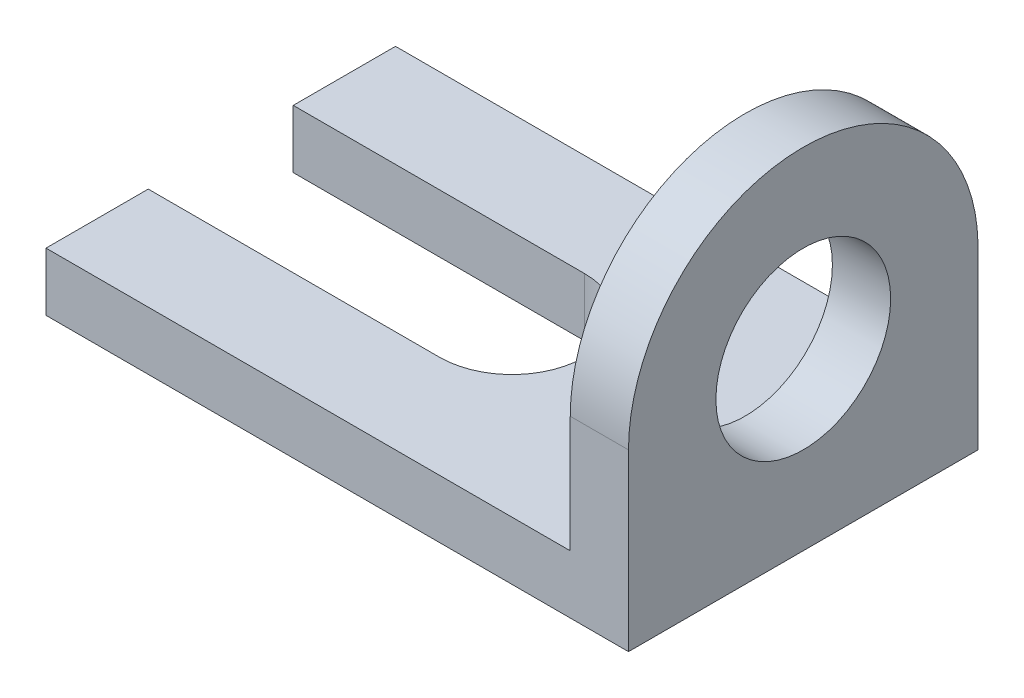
ISO-10303-21;
HEADER;
FILE_DESCRIPTION(('STEP AP214'),'2;1');
FILE_NAME('part.step','',(''),(''),'','','');
FILE_SCHEMA(('AUTOMOTIVE_DESIGN { 1 0 10303 214 1 1 1 1 }'));
ENDSEC;
DATA;
#1=APPLICATION_CONTEXT('core data for automotive mechanical design processes');
#2=APPLICATION_PROTOCOL_DEFINITION('international standard','automotive_design',2000,#1);
#3=PRODUCT_CONTEXT('',#1,'mechanical');
#4=PRODUCT('Part','Part','',(#3));
#5=PRODUCT_RELATED_PRODUCT_CATEGORY('part','',(#4));
#6=PRODUCT_DEFINITION_FORMATION('','',#4);
#7=PRODUCT_DEFINITION_CONTEXT('part definition',#1,'design');
#8=PRODUCT_DEFINITION('design','',#6,#7);
#9=PRODUCT_DEFINITION_SHAPE('','',#8);
#10=(LENGTH_UNIT() NAMED_UNIT(*) SI_UNIT(.MILLI.,.METRE.));
#11=(NAMED_UNIT(*) PLANE_ANGLE_UNIT() SI_UNIT($,.RADIAN.));
#12=(NAMED_UNIT(*) SI_UNIT($,.STERADIAN.) SOLID_ANGLE_UNIT());
#13=UNCERTAINTY_MEASURE_WITH_UNIT(LENGTH_MEASURE(1.E-05),#10,'distance_accuracy_value','');
#14=(GEOMETRIC_REPRESENTATION_CONTEXT(3) GLOBAL_UNCERTAINTY_ASSIGNED_CONTEXT((#13)) GLOBAL_UNIT_ASSIGNED_CONTEXT((#10,
#11,#12)) REPRESENTATION_CONTEXT('',''));
#15=CARTESIAN_POINT('',(0.,0.,0.));
#16=DIRECTION('',(0.,0.,1.));
#17=DIRECTION('',(1.,0.,0.));
#18=AXIS2_PLACEMENT_3D('',#15,#16,#17);
#19=CARTESIAN_POINT('',(-50.,10.,-30.));
#20=DIRECTION('',(1.,0.,0.));
#21=DIRECTION('',(0.,0.,-1.));
#22=AXIS2_PLACEMENT_3D('',#19,#20,#21);
#23=PLANE('',#22);
#24=DIRECTION('',(0.,0.,1.));
#25=VECTOR('',#24,1.);
#26=CARTESIAN_POINT('',(-50.,0.,-30.));
#27=LINE('',#26,#25);
#28=CARTESIAN_POINT('',(-50.,0.,-30.));
#29=VERTEX_POINT('',#28);
#30=CARTESIAN_POINT('',(-50.,0.,-12.4462253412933));
#31=VERTEX_POINT('',#30);
#32=EDGE_CURVE('E166',#29,#31,#27,.T.);
#33=ORIENTED_EDGE('',*,*,#32,.T.);
#34=DIRECTION('',(0.,-1.,0.));
#35=VECTOR('',#34,1.);
#36=CARTESIAN_POINT('',(-50.,10.,-12.4462253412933));
#37=LINE('',#36,#35);
#38=CARTESIAN_POINT('',(-50.,10.,-12.4462253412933));
#39=VERTEX_POINT('',#38);
#40=EDGE_CURVE('E11',#39,#31,#37,.T.);
#41=ORIENTED_EDGE('',*,*,#40,.F.);
#42=DIRECTION('',(0.,0.,1.));
#43=VECTOR('',#42,1.);
#44=CARTESIAN_POINT('',(-50.,10.,-30.));
#45=LINE('',#44,#43);
#46=CARTESIAN_POINT('',(-50.,10.,-30.));
#47=VERTEX_POINT('',#46);
#48=EDGE_CURVE('E170',#47,#39,#45,.T.);
#49=ORIENTED_EDGE('',*,*,#48,.F.);
#50=DIRECTION('',(0.,-1.,0.));
#51=VECTOR('',#50,1.);
#52=CARTESIAN_POINT('',(-50.,10.,-30.));
#53=LINE('',#52,#51);
#54=EDGE_CURVE('E145',#47,#29,#53,.T.);
#55=ORIENTED_EDGE('',*,*,#54,.T.);
#56=EDGE_LOOP('',(#33,#41,#49,#55));
#57=FACE_BOUND('',#56,.T.);
#58=ADVANCED_FACE('F31',(#57),#23,.F.);
#59=CARTESIAN_POINT('',(-50.,10.,-12.4462253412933));
#60=DIRECTION('',(0.,0.,-1.));
#61=DIRECTION('',(-1.,0.,0.));
#62=AXIS2_PLACEMENT_3D('',#59,#60,#61);
#63=PLANE('',#62);
#64=DIRECTION('',(1.,0.,0.));
#65=VECTOR('',#64,1.);
#66=CARTESIAN_POINT('',(-50.,0.,-12.4462253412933));
#67=LINE('',#66,#65);
#68=CARTESIAN_POINT('',(0.,0.,-12.4462253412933));
#69=VERTEX_POINT('',#68);
#70=EDGE_CURVE('E176',#31,#69,#67,.T.);
#71=ORIENTED_EDGE('',*,*,#70,.T.);
#72=DIRECTION('',(0.,-1.,0.));
#73=VECTOR('',#72,1.);
#74=CARTESIAN_POINT('',(0.,10.,-12.4462253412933));
#75=LINE('',#74,#73);
#76=CARTESIAN_POINT('',(0.,10.,-12.4462253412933));
#77=VERTEX_POINT('',#76);
#78=EDGE_CURVE('E39',#77,#69,#75,.T.);
#79=ORIENTED_EDGE('',*,*,#78,.F.);
#80=DIRECTION('',(1.,0.,0.));
#81=VECTOR('',#80,1.);
#82=CARTESIAN_POINT('',(-50.,10.,-12.4462253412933));
#83=LINE('',#82,#81);
#84=EDGE_CURVE('E97',#39,#77,#83,.T.);
#85=ORIENTED_EDGE('',*,*,#84,.F.);
#86=ORIENTED_EDGE('',*,*,#40,.T.);
#87=EDGE_LOOP('',(#71,#79,#85,#86));
#88=FACE_BOUND('',#87,.T.);
#89=ADVANCED_FACE('F175',(#88),#63,.F.);
#90=CARTESIAN_POINT('',(0.,10.,0.));
#91=DIRECTION('',(0.,-1.,0.));
#92=DIRECTION('',(0.,0.,-1.));
#93=AXIS2_PLACEMENT_3D('',#90,#91,#92);
#94=CYLINDRICAL_SURFACE('',#93,12.4462253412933);
#95=CARTESIAN_POINT('',(0.,0.,0.));
#96=DIRECTION('',(0.,-1.,0.));
#97=DIRECTION('',(0.,0.,-1.));
#98=AXIS2_PLACEMENT_3D('',#95,#96,#97);
#99=CIRCLE('',#98,12.4462253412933);
#100=CARTESIAN_POINT('',(0.,0.,12.4462253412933));
#101=VERTEX_POINT('',#100);
#102=EDGE_CURVE('E180',#69,#101,#99,.T.);
#103=ORIENTED_EDGE('',*,*,#102,.T.);
#104=DIRECTION('',(0.,-1.,0.));
#105=VECTOR('',#104,1.);
#106=CARTESIAN_POINT('',(0.,10.,12.4462253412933));
#107=LINE('',#106,#105);
#108=CARTESIAN_POINT('',(0.,10.,12.4462253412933));
#109=VERTEX_POINT('',#108);
#110=EDGE_CURVE('E127',#109,#101,#107,.T.);
#111=ORIENTED_EDGE('',*,*,#110,.F.);
#112=CARTESIAN_POINT('',(0.,10.,0.));
#113=DIRECTION('',(0.,-1.,0.));
#114=DIRECTION('',(0.,0.,-1.));
#115=AXIS2_PLACEMENT_3D('',#112,#113,#114);
#116=CIRCLE('',#115,12.4462253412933);
#117=EDGE_CURVE('E115',#77,#109,#116,.T.);
#118=ORIENTED_EDGE('',*,*,#117,.F.);
#119=ORIENTED_EDGE('',*,*,#78,.T.);
#120=EDGE_LOOP('',(#103,#111,#118,#119));
#121=FACE_BOUND('',#120,.T.);
#122=ADVANCED_FACE('F179',(#121),#94,.F.);
#123=CARTESIAN_POINT('',(0.,10.,12.4462253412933));
#124=DIRECTION('',(0.,0.,1.));
#125=DIRECTION('',(1.,0.,0.));
#126=AXIS2_PLACEMENT_3D('',#123,#124,#125);
#127=PLANE('',#126);
#128=DIRECTION('',(-1.,0.,0.));
#129=VECTOR('',#128,1.);
#130=CARTESIAN_POINT('',(0.,0.,12.4462253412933));
#131=LINE('',#130,#129);
#132=CARTESIAN_POINT('',(-50.,0.,12.4462253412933));
#133=VERTEX_POINT('',#132);
#134=EDGE_CURVE('E124',#101,#133,#131,.T.);
#135=ORIENTED_EDGE('',*,*,#134,.T.);
#136=DIRECTION('',(0.,-1.,0.));
#137=VECTOR('',#136,1.);
#138=CARTESIAN_POINT('',(-50.,10.,12.4462253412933));
#139=LINE('',#138,#137);
#140=CARTESIAN_POINT('',(-50.,10.,12.4462253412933));
#141=VERTEX_POINT('',#140);
#142=EDGE_CURVE('E121',#141,#133,#139,.T.);
#143=ORIENTED_EDGE('',*,*,#142,.F.);
#144=DIRECTION('',(-1.,0.,0.));
#145=VECTOR('',#144,1.);
#146=CARTESIAN_POINT('',(0.,10.,12.4462253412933));
#147=LINE('',#146,#145);
#148=EDGE_CURVE('E107',#109,#141,#147,.T.);
#149=ORIENTED_EDGE('',*,*,#148,.F.);
#150=ORIENTED_EDGE('',*,*,#110,.T.);
#151=EDGE_LOOP('',(#135,#143,#149,#150));
#152=FACE_BOUND('',#151,.T.);
#153=ADVANCED_FACE('F122',(#152),#127,.F.);
#154=CARTESIAN_POINT('',(-50.,10.,12.4462253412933));
#155=DIRECTION('',(1.,0.,0.));
#156=DIRECTION('',(0.,0.,-1.));
#157=AXIS2_PLACEMENT_3D('',#154,#155,#156);
#158=PLANE('',#157);
#159=DIRECTION('',(0.,0.,1.));
#160=VECTOR('',#159,1.);
#161=CARTESIAN_POINT('',(-50.,0.,12.4462253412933));
#162=LINE('',#161,#160);
#163=CARTESIAN_POINT('',(-50.,0.,30.));
#164=VERTEX_POINT('',#163);
#165=EDGE_CURVE('E195',#133,#164,#162,.T.);
#166=ORIENTED_EDGE('',*,*,#165,.T.);
#167=DIRECTION('',(0.,-1.,0.));
#168=VECTOR('',#167,1.);
#169=CARTESIAN_POINT('',(-50.,10.,30.));
#170=LINE('',#169,#168);
#171=CARTESIAN_POINT('',(-50.,10.,30.));
#172=VERTEX_POINT('',#171);
#173=EDGE_CURVE('E128',#172,#164,#170,.T.);
#174=ORIENTED_EDGE('',*,*,#173,.F.);
#175=DIRECTION('',(0.,0.,1.));
#176=VECTOR('',#175,1.);
#177=CARTESIAN_POINT('',(-50.,10.,12.4462253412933));
#178=LINE('',#177,#176);
#179=EDGE_CURVE('E112',#141,#172,#178,.T.);
#180=ORIENTED_EDGE('',*,*,#179,.F.);
#181=ORIENTED_EDGE('',*,*,#142,.T.);
#182=EDGE_LOOP('',(#166,#174,#180,#181));
#183=FACE_BOUND('',#182,.T.);
#184=ADVANCED_FACE('F130',(#183),#158,.F.);
#185=CARTESIAN_POINT('',(-50.,10.,30.));
#186=DIRECTION('',(0.,0.,-1.));
#187=DIRECTION('',(-1.,0.,0.));
#188=AXIS2_PLACEMENT_3D('',#185,#186,#187);
#189=PLANE('',#188);
#190=DIRECTION('',(1.,0.,0.));
#191=VECTOR('',#190,1.);
#192=CARTESIAN_POINT('',(-50.,0.,30.));
#193=LINE('',#192,#191);
#194=CARTESIAN_POINT('',(50.,0.,30.));
#195=VERTEX_POINT('',#194);
#196=EDGE_CURVE('E193',#164,#195,#193,.T.);
#197=ORIENTED_EDGE('',*,*,#196,.T.);
#198=DIRECTION('',(0.,-1.,0.));
#199=VECTOR('',#198,1.);
#200=CARTESIAN_POINT('',(50.,10.,30.));
#201=LINE('',#200,#199);
#202=CARTESIAN_POINT('',(50.,30.,30.));
#203=VERTEX_POINT('',#202);
#204=EDGE_CURVE('E184',#203,#195,#201,.T.);
#205=ORIENTED_EDGE('',*,*,#204,.F.);
#206=DIRECTION('',(1.,0.,0.));
#207=VECTOR('',#206,1.);
#208=CARTESIAN_POINT('',(40.,30.,30.));
#209=LINE('',#208,#207);
#210=CARTESIAN_POINT('',(40.,30.,30.));
#211=VERTEX_POINT('',#210);
#212=EDGE_CURVE('E163',#211,#203,#209,.T.);
#213=ORIENTED_EDGE('',*,*,#212,.F.);
#214=DIRECTION('',(0.,-1.,0.));
#215=VECTOR('',#214,1.);
#216=CARTESIAN_POINT('',(40.,10.,30.));
#217=LINE('',#216,#215);
#218=CARTESIAN_POINT('',(40.,10.,30.));
#219=VERTEX_POINT('',#218);
#220=EDGE_CURVE('E159',#211,#219,#217,.T.);
#221=ORIENTED_EDGE('',*,*,#220,.T.);
#222=DIRECTION('',(1.,0.,0.));
#223=VECTOR('',#222,1.);
#224=CARTESIAN_POINT('',(-50.,10.,30.));
#225=LINE('',#224,#223);
#226=EDGE_CURVE('E133',#172,#219,#225,.T.);
#227=ORIENTED_EDGE('',*,*,#226,.F.);
#228=ORIENTED_EDGE('',*,*,#173,.T.);
#229=EDGE_LOOP('',(#197,#205,#213,#221,#227,#228));
#230=FACE_BOUND('',#229,.T.);
#231=ADVANCED_FACE('F207',(#230),#189,.F.);
#232=CARTESIAN_POINT('',(50.,10.,-30.));
#233=DIRECTION('',(-1.,0.,0.));
#234=DIRECTION('',(0.,0.,1.));
#235=AXIS2_PLACEMENT_3D('',#232,#233,#234);
#236=PLANE('',#235);
#237=DIRECTION('',(0.,0.,-1.));
#238=VECTOR('',#237,1.);
#239=CARTESIAN_POINT('',(50.,0.,-30.));
#240=LINE('',#239,#238);
#241=CARTESIAN_POINT('',(50.,0.,-30.));
#242=VERTEX_POINT('',#241);
#243=EDGE_CURVE('E191',#195,#242,#240,.T.);
#244=ORIENTED_EDGE('',*,*,#243,.T.);
#245=DIRECTION('',(0.,-1.,0.));
#246=VECTOR('',#245,1.);
#247=CARTESIAN_POINT('',(50.,10.,-30.));
#248=LINE('',#247,#246);
#249=CARTESIAN_POINT('',(50.,30.7617208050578,-30.));
#250=VERTEX_POINT('',#249);
#251=EDGE_CURVE('E187',#250,#242,#248,.T.);
#252=ORIENTED_EDGE('',*,*,#251,.F.);
#253=CARTESIAN_POINT('',(50.,30.,-0.00483515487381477));
#254=DIRECTION('',(1.,0.,0.));
#255=DIRECTION('',(0.,0.,1.));
#256=AXIS2_PLACEMENT_3D('',#253,#254,#255);
#257=CIRCLE('',#256,30.0048351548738);
#258=EDGE_CURVE('E149',#250,#203,#257,.T.);
#259=ORIENTED_EDGE('',*,*,#258,.T.);
#260=ORIENTED_EDGE('',*,*,#204,.T.);
#261=EDGE_LOOP('',(#244,#252,#259,#260));
#262=FACE_BOUND('',#261,.T.);
#263=CARTESIAN_POINT('',(50.,30.,-0.00483515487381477));
#264=DIRECTION('',(1.,0.,0.));
#265=DIRECTION('',(0.,0.,-1.));
#266=AXIS2_PLACEMENT_3D('',#263,#264,#265);
#267=CIRCLE('',#266,15.);
#268=CARTESIAN_POINT('',(50.,30.,-15.0048351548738));
#269=VERTEX_POINT('',#268);
#270=EDGE_CURVE('E154',#269,#269,#267,.T.);
#271=ORIENTED_EDGE('',*,*,#270,.F.);
#272=EDGE_LOOP('',(#271));
#273=FACE_BOUND('',#272,.T.);
#274=ADVANCED_FACE('F227',(#262,#273),#236,.F.);
#275=CARTESIAN_POINT('',(-50.,10.,-30.));
#276=DIRECTION('',(0.,0.,1.));
#277=DIRECTION('',(1.,0.,0.));
#278=AXIS2_PLACEMENT_3D('',#275,#276,#277);
#279=PLANE('',#278);
#280=DIRECTION('',(-1.,0.,0.));
#281=VECTOR('',#280,1.);
#282=CARTESIAN_POINT('',(-50.,0.,-30.));
#283=LINE('',#282,#281);
#284=EDGE_CURVE('E89',#242,#29,#283,.T.);
#285=ORIENTED_EDGE('',*,*,#284,.T.);
#286=ORIENTED_EDGE('',*,*,#54,.F.);
#287=DIRECTION('',(-1.,0.,0.));
#288=VECTOR('',#287,1.);
#289=CARTESIAN_POINT('',(-50.,10.,-30.));
#290=LINE('',#289,#288);
#291=CARTESIAN_POINT('',(40.,10.,-30.));
#292=VERTEX_POINT('',#291);
#293=EDGE_CURVE('E55',#292,#47,#290,.T.);
#294=ORIENTED_EDGE('',*,*,#293,.F.);
#295=DIRECTION('',(0.,1.,0.));
#296=VECTOR('',#295,1.);
#297=CARTESIAN_POINT('',(40.,30.7617208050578,-30.));
#298=LINE('',#297,#296);
#299=CARTESIAN_POINT('',(40.,30.7617208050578,-30.));
#300=VERTEX_POINT('',#299);
#301=EDGE_CURVE('E47',#292,#300,#298,.T.);
#302=ORIENTED_EDGE('',*,*,#301,.T.);
#303=DIRECTION('',(1.,0.,0.));
#304=VECTOR('',#303,1.);
#305=CARTESIAN_POINT('',(40.,30.7617208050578,-30.));
#306=LINE('',#305,#304);
#307=EDGE_CURVE('E167',#300,#250,#306,.T.);
#308=ORIENTED_EDGE('',*,*,#307,.T.);
#309=ORIENTED_EDGE('',*,*,#251,.T.);
#310=EDGE_LOOP('',(#285,#286,#294,#302,#308,#309));
#311=FACE_BOUND('',#310,.T.);
#312=ADVANCED_FACE('F225',(#311),#279,.F.);
#313=CARTESIAN_POINT('',(0.,10.,0.));
#314=DIRECTION('',(0.,-1.,0.));
#315=DIRECTION('',(0.,0.,-1.));
#316=AXIS2_PLACEMENT_3D('',#313,#314,#315);
#317=PLANE('',#316);
#318=ORIENTED_EDGE('',*,*,#226,.T.);
#319=DIRECTION('',(0.,0.,-1.));
#320=VECTOR('',#319,1.);
#321=CARTESIAN_POINT('',(40.,10.,-30.));
#322=LINE('',#321,#320);
#323=EDGE_CURVE('E146',#219,#292,#322,.T.);
#324=ORIENTED_EDGE('',*,*,#323,.T.);
#325=ORIENTED_EDGE('',*,*,#293,.T.);
#326=ORIENTED_EDGE('',*,*,#48,.T.);
#327=ORIENTED_EDGE('',*,*,#84,.T.);
#328=ORIENTED_EDGE('',*,*,#117,.T.);
#329=ORIENTED_EDGE('',*,*,#148,.T.);
#330=ORIENTED_EDGE('',*,*,#179,.T.);
#331=EDGE_LOOP('',(#318,#324,#325,#326,#327,#328,#329,#330));
#332=FACE_BOUND('',#331,.T.);
#333=ADVANCED_FACE('F110',(#332),#317,.F.);
#334=CARTESIAN_POINT('',(0.,0.,0.));
#335=DIRECTION('',(0.,-1.,0.));
#336=DIRECTION('',(0.,0.,-1.));
#337=AXIS2_PLACEMENT_3D('',#334,#335,#336);
#338=PLANE('',#337);
#339=ORIENTED_EDGE('',*,*,#32,.F.);
#340=ORIENTED_EDGE('',*,*,#284,.F.);
#341=ORIENTED_EDGE('',*,*,#243,.F.);
#342=ORIENTED_EDGE('',*,*,#196,.F.);
#343=ORIENTED_EDGE('',*,*,#165,.F.);
#344=ORIENTED_EDGE('',*,*,#134,.F.);
#345=ORIENTED_EDGE('',*,*,#102,.F.);
#346=ORIENTED_EDGE('',*,*,#70,.F.);
#347=EDGE_LOOP('',(#339,#340,#341,#342,#343,#344,#345,#346));
#348=FACE_BOUND('',#347,.T.);
#349=ADVANCED_FACE('F203',(#348),#338,.T.);
#350=CARTESIAN_POINT('',(40.,30.,-0.00483515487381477));
#351=DIRECTION('',(1.,0.,0.));
#352=DIRECTION('',(0.,0.,-1.));
#353=AXIS2_PLACEMENT_3D('',#350,#351,#352);
#354=CYLINDRICAL_SURFACE('',#353,30.0048351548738);
#355=ORIENTED_EDGE('',*,*,#258,.F.);
#356=ORIENTED_EDGE('',*,*,#307,.F.);
#357=CARTESIAN_POINT('',(40.,30.,-0.00483515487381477));
#358=DIRECTION('',(1.,0.,0.));
#359=DIRECTION('',(0.,0.,1.));
#360=AXIS2_PLACEMENT_3D('',#357,#358,#359);
#361=CIRCLE('',#360,30.0048351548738);
#362=EDGE_CURVE('E156',#300,#211,#361,.T.);
#363=ORIENTED_EDGE('',*,*,#362,.T.);
#364=ORIENTED_EDGE('',*,*,#212,.T.);
#365=EDGE_LOOP('',(#355,#356,#363,#364));
#366=FACE_BOUND('',#365,.T.);
#367=ADVANCED_FACE('F223',(#366),#354,.T.);
#368=CARTESIAN_POINT('',(40.,30.,-0.00483515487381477));
#369=DIRECTION('',(-1.,0.,0.));
#370=DIRECTION('',(0.,0.,1.));
#371=AXIS2_PLACEMENT_3D('',#368,#369,#370);
#372=PLANE('',#371);
#373=CARTESIAN_POINT('',(40.,30.,-0.00483515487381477));
#374=DIRECTION('',(1.,0.,0.));
#375=DIRECTION('',(0.,0.,-1.));
#376=AXIS2_PLACEMENT_3D('',#373,#374,#375);
#377=CIRCLE('',#376,15.);
#378=CARTESIAN_POINT('',(40.,30.,-15.0048351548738));
#379=VERTEX_POINT('',#378);
#380=EDGE_CURVE('E162',#379,#379,#377,.T.);
#381=ORIENTED_EDGE('',*,*,#380,.T.);
#382=EDGE_LOOP('',(#381));
#383=FACE_BOUND('',#382,.T.);
#384=ORIENTED_EDGE('',*,*,#323,.F.);
#385=ORIENTED_EDGE('',*,*,#220,.F.);
#386=ORIENTED_EDGE('',*,*,#362,.F.);
#387=ORIENTED_EDGE('',*,*,#301,.F.);
#388=EDGE_LOOP('',(#384,#385,#386,#387));
#389=FACE_BOUND('',#388,.T.);
#390=ADVANCED_FACE('F224',(#383,#389),#372,.T.);
#391=CARTESIAN_POINT('',(40.,30.,-0.00483515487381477));
#392=DIRECTION('',(1.,0.,0.));
#393=DIRECTION('',(0.,0.,-1.));
#394=AXIS2_PLACEMENT_3D('',#391,#392,#393);
#395=CYLINDRICAL_SURFACE('',#394,15.);
#396=ORIENTED_EDGE('',*,*,#380,.F.);
#397=EDGE_LOOP('',(#396));
#398=FACE_BOUND('',#397,.T.);
#399=ORIENTED_EDGE('',*,*,#270,.T.);
#400=EDGE_LOOP('',(#399));
#401=FACE_BOUND('',#400,.T.);
#402=ADVANCED_FACE('F290',(#398,#401),#395,.F.);
#403=CLOSED_SHELL('',(#58,#89,#122,#153,#184,#231,#274,#312,#333,#349,#367,#390,#402));
#404=MANIFOLD_SOLID_BREP('B2',#403);
#405=ADVANCED_BREP_SHAPE_REPRESENTATION('',(#18,#404),#14);
#406=SHAPE_DEFINITION_REPRESENTATION(#9,#405);
ENDSEC;
END-ISO-10303-21;
